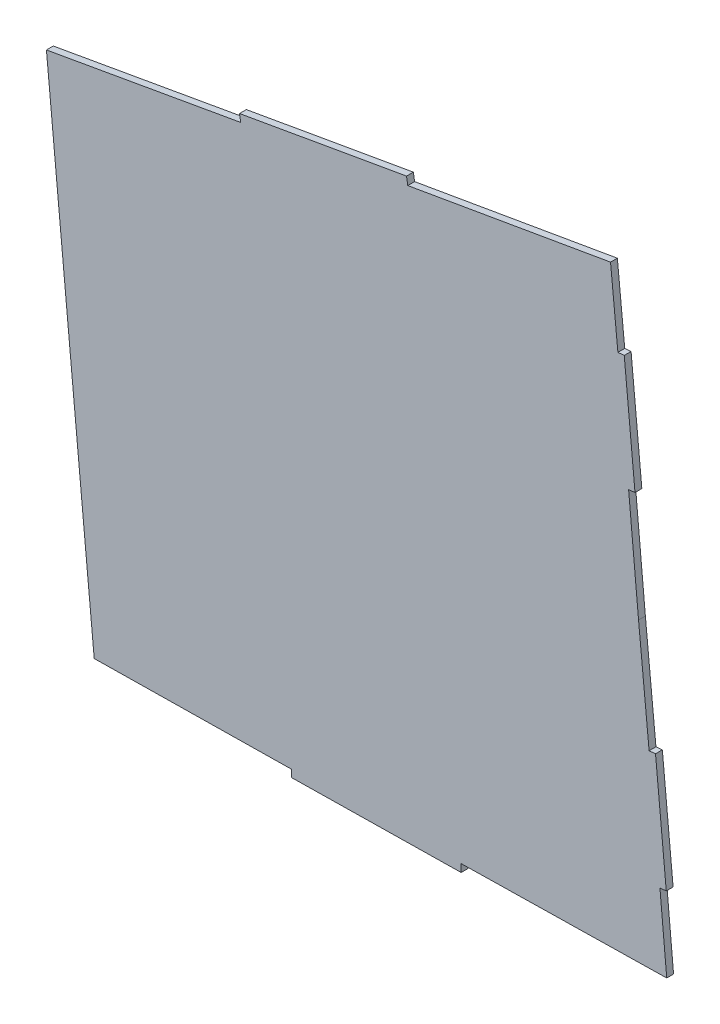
from build123d import *

# Parameters (mm, degrees)
BOSS_EXTRUDE1_DEPTH = 1.524


with BuildPart() as part:
    # Sketch1 → Boss-Extrude1 (new body)
    with BuildSketch(Plane.XY):
        Polygon((142.916382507, 117.545189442), (144.331202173, 117.679503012), (146.731716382, 92.393191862), (145.304978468, 92.257746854), (147.519677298, 68.178790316), (149.875498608, 44.113231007), (151.302236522, 44.248676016), (153.702750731, 18.962364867), (152.287931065, 18.828051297), (153.802534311, 2.206458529), (107.937724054, 1.379708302), (107.979031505, -0.336924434), (70.183142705, -0.920844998), (70.150998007, 0.690740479), (26.170197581, 0.065616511), (15.521033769, 112.24077824), (58.833805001, 119.902725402), (58.562122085, 121.491570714), (95.792713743, 128.030165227), (96.075164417, 126.336425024), (141.276230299, 134.154863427), align=None)
    extrude(amount=BOSS_EXTRUDE1_DEPTH)


solid = part.part
